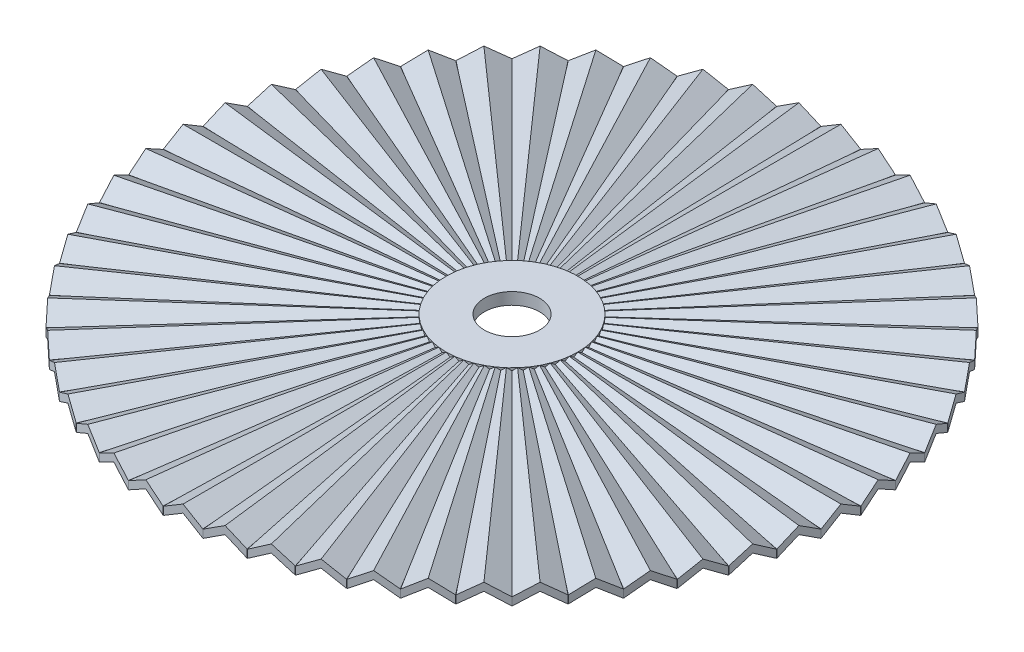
from build123d import *

# Parameters (mm, degrees)
SALIENTE_EXTRUIR1_DEPTH      = 200
CORTAR_EXTRUIR1_DEPTH        = 200
MATRIZC1_COUNT               = 52
SALIENTE_EXTRUIR2_DEPTH      = 6
SALIENTE_EXTRUIR2_DEPTH_BACK = 3
CROQUIS6_R                   = 50
CROQUIS7_R                   = 21
CORTAR_EXTRUIR2_DEPTH        = 40


with BuildPart() as part:
    # Croquis1 → Saliente-Extruir1 (new body)
    with BuildSketch(Plane.XY.offset(250)):
        Polygon((0, 6), (-15, -2.938354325), (-15, -9), (0, 0), (15, -9), (15, -2.938354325), align=None)
    extrude(amount=-SALIENTE_EXTRUIR1_DEPTH)

    # Croquis4 → Cortar-Extruir1 (cut)
    with BuildSketch(Plane(origin=(0, 6, 0), x_dir=(1, 0, 0), z_dir=(0, 1, 0))):
        Polygon((0, -50), (-5, -50), (-15, -249.549594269), (-28.729515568, -250), (-28.729515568, -15.319117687), (28.723249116, -15.319117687), (28.723249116, -250), (14.993733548, -249.549594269), (5, -50), align=None)
    extrude(amount=-CORTAR_EXTRUIR1_DEPTH, mode=Mode.SUBTRACT)


with BuildPart() as matrizc1_1:
    # MatrizC1: pattern copy
    add(part.part.rotate(Axis((0, 0, 0), (0, 1, 0)), 1 * 360 / MATRIZC1_COUNT))


with BuildPart() as matrizc1_2:
    # MatrizC1: pattern copy
    add(part.part.rotate(Axis((0, 0, 0), (0, 1, 0)), 2 * 360 / MATRIZC1_COUNT))


with BuildPart() as matrizc1_3:
    # MatrizC1: pattern copy
    add(part.part.rotate(Axis((0, 0, 0), (0, 1, 0)), 3 * 360 / MATRIZC1_COUNT))


with BuildPart() as matrizc1_4:
    # MatrizC1: pattern copy
    add(part.part.rotate(Axis((0, 0, 0), (0, 1, 0)), 4 * 360 / MATRIZC1_COUNT))


with BuildPart() as matrizc1_5:
    # MatrizC1: pattern copy
    add(part.part.rotate(Axis((0, 0, 0), (0, 1, 0)), 5 * 360 / MATRIZC1_COUNT))


with BuildPart() as matrizc1_6:
    # MatrizC1: pattern copy
    add(part.part.rotate(Axis((0, 0, 0), (0, 1, 0)), 6 * 360 / MATRIZC1_COUNT))


with BuildPart() as matrizc1_7:
    # MatrizC1: pattern copy
    add(part.part.rotate(Axis((0, 0, 0), (0, 1, 0)), 7 * 360 / MATRIZC1_COUNT))


with BuildPart() as matrizc1_8:
    # MatrizC1: pattern copy
    add(part.part.rotate(Axis((0, 0, 0), (0, 1, 0)), 8 * 360 / MATRIZC1_COUNT))


with BuildPart() as matrizc1_9:
    # MatrizC1: pattern copy
    add(part.part.rotate(Axis((0, 0, 0), (0, 1, 0)), 9 * 360 / MATRIZC1_COUNT))


with BuildPart() as matrizc1_10:
    # MatrizC1: pattern copy
    add(part.part.rotate(Axis((0, 0, 0), (0, 1, 0)), 10 * 360 / MATRIZC1_COUNT))


with BuildPart() as matrizc1_11:
    # MatrizC1: pattern copy
    add(part.part.rotate(Axis((0, 0, 0), (0, 1, 0)), 11 * 360 / MATRIZC1_COUNT))


with BuildPart() as matrizc1_12:
    # MatrizC1: pattern copy
    add(part.part.rotate(Axis((0, 0, 0), (0, 1, 0)), 12 * 360 / MATRIZC1_COUNT))


with BuildPart() as matrizc1_13:
    # MatrizC1: pattern copy
    add(part.part.rotate(Axis((0, 0, 0), (0, 1, 0)), 13 * 360 / MATRIZC1_COUNT))


with BuildPart() as matrizc1_14:
    # MatrizC1: pattern copy
    add(part.part.rotate(Axis((0, 0, 0), (0, 1, 0)), 14 * 360 / MATRIZC1_COUNT))


with BuildPart() as matrizc1_15:
    # MatrizC1: pattern copy
    add(part.part.rotate(Axis((0, 0, 0), (0, 1, 0)), 15 * 360 / MATRIZC1_COUNT))


with BuildPart() as matrizc1_16:
    # MatrizC1: pattern copy
    add(part.part.rotate(Axis((0, 0, 0), (0, 1, 0)), 16 * 360 / MATRIZC1_COUNT))


with BuildPart() as matrizc1_17:
    # MatrizC1: pattern copy
    add(part.part.rotate(Axis((0, 0, 0), (0, 1, 0)), 17 * 360 / MATRIZC1_COUNT))


with BuildPart() as matrizc1_18:
    # MatrizC1: pattern copy
    add(part.part.rotate(Axis((0, 0, 0), (0, 1, 0)), 18 * 360 / MATRIZC1_COUNT))


with BuildPart() as matrizc1_19:
    # MatrizC1: pattern copy
    add(part.part.rotate(Axis((0, 0, 0), (0, 1, 0)), 19 * 360 / MATRIZC1_COUNT))


with BuildPart() as matrizc1_20:
    # MatrizC1: pattern copy
    add(part.part.rotate(Axis((0, 0, 0), (0, 1, 0)), 20 * 360 / MATRIZC1_COUNT))


with BuildPart() as matrizc1_21:
    # MatrizC1: pattern copy
    add(part.part.rotate(Axis((0, 0, 0), (0, 1, 0)), 21 * 360 / MATRIZC1_COUNT))


with BuildPart() as matrizc1_22:
    # MatrizC1: pattern copy
    add(part.part.rotate(Axis((0, 0, 0), (0, 1, 0)), 22 * 360 / MATRIZC1_COUNT))


with BuildPart() as matrizc1_23:
    # MatrizC1: pattern copy
    add(part.part.rotate(Axis((0, 0, 0), (0, 1, 0)), 23 * 360 / MATRIZC1_COUNT))


with BuildPart() as matrizc1_24:
    # MatrizC1: pattern copy
    add(part.part.rotate(Axis((0, 0, 0), (0, 1, 0)), 24 * 360 / MATRIZC1_COUNT))


with BuildPart() as matrizc1_25:
    # MatrizC1: pattern copy
    add(part.part.rotate(Axis((0, 0, 0), (0, 1, 0)), 25 * 360 / MATRIZC1_COUNT))


with BuildPart() as matrizc1_26:
    # MatrizC1: pattern copy
    add(part.part.rotate(Axis((0, 0, 0), (0, 1, 0)), 26 * 360 / MATRIZC1_COUNT))


with BuildPart() as matrizc1_27:
    # MatrizC1: pattern copy
    add(part.part.rotate(Axis((0, 0, 0), (0, 1, 0)), 27 * 360 / MATRIZC1_COUNT))


with BuildPart() as matrizc1_28:
    # MatrizC1: pattern copy
    add(part.part.rotate(Axis((0, 0, 0), (0, 1, 0)), 28 * 360 / MATRIZC1_COUNT))


with BuildPart() as matrizc1_29:
    # MatrizC1: pattern copy
    add(part.part.rotate(Axis((0, 0, 0), (0, 1, 0)), 29 * 360 / MATRIZC1_COUNT))


with BuildPart() as matrizc1_30:
    # MatrizC1: pattern copy
    add(part.part.rotate(Axis((0, 0, 0), (0, 1, 0)), 30 * 360 / MATRIZC1_COUNT))


with BuildPart() as matrizc1_31:
    # MatrizC1: pattern copy
    add(part.part.rotate(Axis((0, 0, 0), (0, 1, 0)), 31 * 360 / MATRIZC1_COUNT))


with BuildPart() as matrizc1_32:
    # MatrizC1: pattern copy
    add(part.part.rotate(Axis((0, 0, 0), (0, 1, 0)), 32 * 360 / MATRIZC1_COUNT))


with BuildPart() as matrizc1_33:
    # MatrizC1: pattern copy
    add(part.part.rotate(Axis((0, 0, 0), (0, 1, 0)), 33 * 360 / MATRIZC1_COUNT))


with BuildPart() as matrizc1_34:
    # MatrizC1: pattern copy
    add(part.part.rotate(Axis((0, 0, 0), (0, 1, 0)), 34 * 360 / MATRIZC1_COUNT))


with BuildPart() as matrizc1_35:
    # MatrizC1: pattern copy
    add(part.part.rotate(Axis((0, 0, 0), (0, 1, 0)), 35 * 360 / MATRIZC1_COUNT))


with BuildPart() as matrizc1_36:
    # MatrizC1: pattern copy
    add(part.part.rotate(Axis((0, 0, 0), (0, 1, 0)), 36 * 360 / MATRIZC1_COUNT))


with BuildPart() as matrizc1_37:
    # MatrizC1: pattern copy
    add(part.part.rotate(Axis((0, 0, 0), (0, 1, 0)), 37 * 360 / MATRIZC1_COUNT))


with BuildPart() as matrizc1_38:
    # MatrizC1: pattern copy
    add(part.part.rotate(Axis((0, 0, 0), (0, 1, 0)), 38 * 360 / MATRIZC1_COUNT))


with BuildPart() as matrizc1_39:
    # MatrizC1: pattern copy
    add(part.part.rotate(Axis((0, 0, 0), (0, 1, 0)), 39 * 360 / MATRIZC1_COUNT))


with BuildPart() as matrizc1_40:
    # MatrizC1: pattern copy
    add(part.part.rotate(Axis((0, 0, 0), (0, 1, 0)), 40 * 360 / MATRIZC1_COUNT))


with BuildPart() as matrizc1_41:
    # MatrizC1: pattern copy
    add(part.part.rotate(Axis((0, 0, 0), (0, 1, 0)), 41 * 360 / MATRIZC1_COUNT))


with BuildPart() as matrizc1_42:
    # MatrizC1: pattern copy
    add(part.part.rotate(Axis((0, 0, 0), (0, 1, 0)), 42 * 360 / MATRIZC1_COUNT))


with BuildPart() as matrizc1_43:
    # MatrizC1: pattern copy
    add(part.part.rotate(Axis((0, 0, 0), (0, 1, 0)), 43 * 360 / MATRIZC1_COUNT))


with BuildPart() as matrizc1_44:
    # MatrizC1: pattern copy
    add(part.part.rotate(Axis((0, 0, 0), (0, 1, 0)), 44 * 360 / MATRIZC1_COUNT))


with BuildPart() as matrizc1_45:
    # MatrizC1: pattern copy
    add(part.part.rotate(Axis((0, 0, 0), (0, 1, 0)), 45 * 360 / MATRIZC1_COUNT))


with BuildPart() as matrizc1_46:
    # MatrizC1: pattern copy
    add(part.part.rotate(Axis((0, 0, 0), (0, 1, 0)), 46 * 360 / MATRIZC1_COUNT))


with BuildPart() as matrizc1_47:
    # MatrizC1: pattern copy
    add(part.part.rotate(Axis((0, 0, 0), (0, 1, 0)), 47 * 360 / MATRIZC1_COUNT))


with BuildPart() as matrizc1_48:
    # MatrizC1: pattern copy
    add(part.part.rotate(Axis((0, 0, 0), (0, 1, 0)), 48 * 360 / MATRIZC1_COUNT))


with BuildPart() as matrizc1_49:
    # MatrizC1: pattern copy
    add(part.part.rotate(Axis((0, 0, 0), (0, 1, 0)), 49 * 360 / MATRIZC1_COUNT))


with BuildPart() as matrizc1_50:
    # MatrizC1: pattern copy
    add(part.part.rotate(Axis((0, 0, 0), (0, 1, 0)), 50 * 360 / MATRIZC1_COUNT))


with BuildPart() as matrizc1_51:
    # MatrizC1: pattern copy
    add(part.part.rotate(Axis((0, 0, 0), (0, 1, 0)), 51 * 360 / MATRIZC1_COUNT))


with BuildPart() as part_1:
    add(part.part)

    add(matrizc1_1.part)  # Saliente-Extruir2 merges MatrizC1_1

    add(matrizc1_2.part)  # Saliente-Extruir2 merges MatrizC1_2

    add(matrizc1_3.part)  # Saliente-Extruir2 merges MatrizC1_3

    add(matrizc1_4.part)  # Saliente-Extruir2 merges MatrizC1_4

    add(matrizc1_5.part)  # Saliente-Extruir2 merges MatrizC1_5

    add(matrizc1_6.part)  # Saliente-Extruir2 merges MatrizC1_6

    add(matrizc1_7.part)  # Saliente-Extruir2 merges MatrizC1_7

    add(matrizc1_8.part)  # Saliente-Extruir2 merges MatrizC1_8

    add(matrizc1_9.part)  # Saliente-Extruir2 merges MatrizC1_9

    add(matrizc1_10.part)  # Saliente-Extruir2 merges MatrizC1_10

    add(matrizc1_11.part)  # Saliente-Extruir2 merges MatrizC1_11

    add(matrizc1_12.part)  # Saliente-Extruir2 merges MatrizC1_12

    add(matrizc1_13.part)  # Saliente-Extruir2 merges MatrizC1_13

    add(matrizc1_14.part)  # Saliente-Extruir2 merges MatrizC1_14

    add(matrizc1_15.part)  # Saliente-Extruir2 merges MatrizC1_15

    add(matrizc1_16.part)  # Saliente-Extruir2 merges MatrizC1_16

    add(matrizc1_17.part)  # Saliente-Extruir2 merges MatrizC1_17

    add(matrizc1_18.part)  # Saliente-Extruir2 merges MatrizC1_18

    add(matrizc1_19.part)  # Saliente-Extruir2 merges MatrizC1_19

    add(matrizc1_20.part)  # Saliente-Extruir2 merges MatrizC1_20

    add(matrizc1_21.part)  # Saliente-Extruir2 merges MatrizC1_21

    add(matrizc1_22.part)  # Saliente-Extruir2 merges MatrizC1_22

    add(matrizc1_23.part)  # Saliente-Extruir2 merges MatrizC1_23

    add(matrizc1_24.part)  # Saliente-Extruir2 merges MatrizC1_24

    add(matrizc1_25.part)  # Saliente-Extruir2 merges MatrizC1_25

    add(matrizc1_26.part)  # Saliente-Extruir2 merges MatrizC1_26

    add(matrizc1_27.part)  # Saliente-Extruir2 merges MatrizC1_27

    add(matrizc1_28.part)  # Saliente-Extruir2 merges MatrizC1_28

    add(matrizc1_29.part)  # Saliente-Extruir2 merges MatrizC1_29

    add(matrizc1_30.part)  # Saliente-Extruir2 merges MatrizC1_30

    add(matrizc1_31.part)  # Saliente-Extruir2 merges MatrizC1_31

    add(matrizc1_32.part)  # Saliente-Extruir2 merges MatrizC1_32

    add(matrizc1_33.part)  # Saliente-Extruir2 merges MatrizC1_33

    add(matrizc1_34.part)  # Saliente-Extruir2 merges MatrizC1_34

    add(matrizc1_35.part)  # Saliente-Extruir2 merges MatrizC1_35

    add(matrizc1_36.part)  # Saliente-Extruir2 merges MatrizC1_36

    add(matrizc1_37.part)  # Saliente-Extruir2 merges MatrizC1_37

    add(matrizc1_38.part)  # Saliente-Extruir2 merges MatrizC1_38

    add(matrizc1_39.part)  # Saliente-Extruir2 merges MatrizC1_39

    add(matrizc1_40.part)  # Saliente-Extruir2 merges MatrizC1_40

    add(matrizc1_41.part)  # Saliente-Extruir2 merges MatrizC1_41

    add(matrizc1_42.part)  # Saliente-Extruir2 merges MatrizC1_42

    add(matrizc1_43.part)  # Saliente-Extruir2 merges MatrizC1_43

    add(matrizc1_44.part)  # Saliente-Extruir2 merges MatrizC1_44

    add(matrizc1_45.part)  # Saliente-Extruir2 merges MatrizC1_45

    add(matrizc1_46.part)  # Saliente-Extruir2 merges MatrizC1_46

    add(matrizc1_47.part)  # Saliente-Extruir2 merges MatrizC1_47

    add(matrizc1_48.part)  # Saliente-Extruir2 merges MatrizC1_48

    add(matrizc1_49.part)  # Saliente-Extruir2 merges MatrizC1_49

    add(matrizc1_50.part)  # Saliente-Extruir2 merges MatrizC1_50

    add(matrizc1_51.part)  # Saliente-Extruir2 merges MatrizC1_51
    # Croquis6 → Saliente-Extruir2 (add, two sides: drawn at the far end of the back side and taken through both)
    with BuildSketch(Plane(origin=(0, 0, 0), x_dir=(1, 0, 0), z_dir=(0, 1, 0)).offset(-SALIENTE_EXTRUIR2_DEPTH_BACK)):
        with Locations(Location((0, 0, 0), (0, 0, 270))):
            Circle(CROQUIS6_R)
    extrude(amount=SALIENTE_EXTRUIR2_DEPTH + SALIENTE_EXTRUIR2_DEPTH_BACK)

    # Croquis7 → Cortar-Extruir2 (cut, symmetric)
    with BuildSketch(Plane(origin=(0, 0, 0), x_dir=(1, 0, 0), z_dir=(0, 1, 0))):
        with Locations(Location((0, 0, 0), (0, 0, 270))):
            Circle(CROQUIS7_R)
    extrude(amount=CORTAR_EXTRUIR2_DEPTH, both=True, mode=Mode.SUBTRACT)


solid = part_1.part
